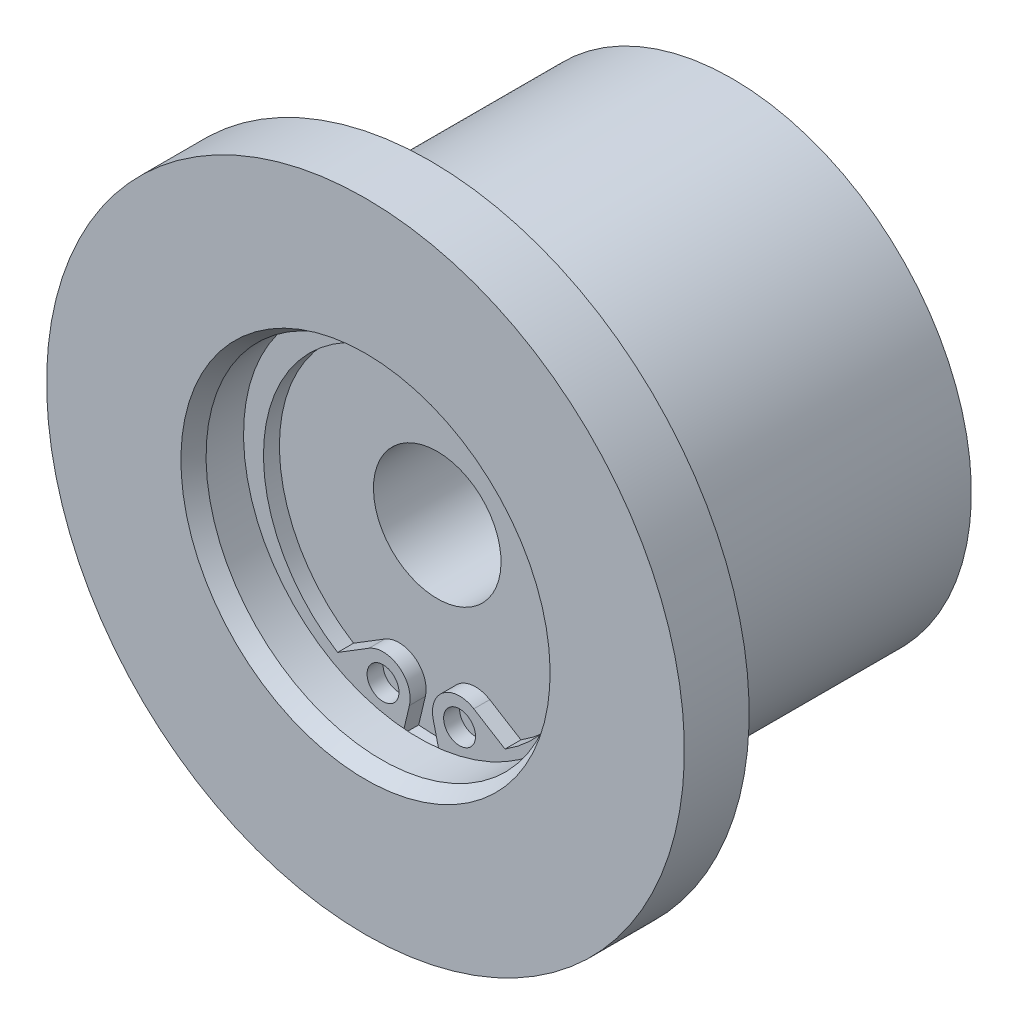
ISO-10303-21;
HEADER;
FILE_DESCRIPTION(('STEP AP214'),'2;1');
FILE_NAME('part.step','',(''),(''),'','','');
FILE_SCHEMA(('AUTOMOTIVE_DESIGN { 1 0 10303 214 1 1 1 1 }'));
ENDSEC;
DATA;
#1=APPLICATION_CONTEXT('core data for automotive mechanical design processes');
#2=APPLICATION_PROTOCOL_DEFINITION('international standard','automotive_design',2000,#1);
#3=PRODUCT_CONTEXT('',#1,'mechanical');
#4=PRODUCT('Part','Part','',(#3));
#5=PRODUCT_RELATED_PRODUCT_CATEGORY('part','',(#4));
#6=PRODUCT_DEFINITION_FORMATION('','',#4);
#7=PRODUCT_DEFINITION_CONTEXT('part definition',#1,'design');
#8=PRODUCT_DEFINITION('design','',#6,#7);
#9=PRODUCT_DEFINITION_SHAPE('','',#8);
#10=(LENGTH_UNIT() NAMED_UNIT(*) SI_UNIT(.MILLI.,.METRE.));
#11=(NAMED_UNIT(*) PLANE_ANGLE_UNIT() SI_UNIT($,.RADIAN.));
#12=(NAMED_UNIT(*) SI_UNIT($,.STERADIAN.) SOLID_ANGLE_UNIT());
#13=UNCERTAINTY_MEASURE_WITH_UNIT(LENGTH_MEASURE(1.E-05),#10,'distance_accuracy_value','');
#14=(GEOMETRIC_REPRESENTATION_CONTEXT(3) GLOBAL_UNCERTAINTY_ASSIGNED_CONTEXT((#13)) GLOBAL_UNIT_ASSIGNED_CONTEXT((#10,
#11,#12)) REPRESENTATION_CONTEXT('',''));
#15=CARTESIAN_POINT('',(0.,0.,0.));
#16=DIRECTION('',(0.,0.,1.));
#17=DIRECTION('',(1.,0.,0.));
#18=AXIS2_PLACEMENT_3D('',#15,#16,#17);
#19=CARTESIAN_POINT('',(0.,4.,7.));
#20=DIRECTION('',(0.,0.,1.));
#21=DIRECTION('',(0.,-1.,0.));
#22=AXIS2_PLACEMENT_3D('',#19,#20,#21);
#23=PLANE('',#22);
#24=CARTESIAN_POINT('',(2.4,-9.28614557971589,7.));
#25=DIRECTION('',(0.,0.,1.));
#26=DIRECTION('',(1.,0.,0.));
#27=AXIS2_PLACEMENT_3D('',#24,#25,#26);
#28=CIRCLE('',#27,1.);
#29=CARTESIAN_POINT('',(3.4,-9.28614557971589,7.));
#30=VERTEX_POINT('',#29);
#31=EDGE_CURVE('E551',#30,#30,#28,.T.);
#32=ORIENTED_EDGE('',*,*,#31,.T.);
#33=EDGE_LOOP('',(#32));
#34=FACE_BOUND('',#33,.T.);
#35=ADVANCED_FACE('F14',(#34),#23,.T.);
#36=CARTESIAN_POINT('',(-2.4,-9.28614557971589,7.));
#37=DIRECTION('',(0.,0.,-1.));
#38=DIRECTION('',(1.,0.,0.));
#39=AXIS2_PLACEMENT_3D('',#36,#37,#38);
#40=CIRCLE('',#39,1.);
#41=CARTESIAN_POINT('',(-1.4,-9.28614557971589,7.));
#42=VERTEX_POINT('',#41);
#43=EDGE_CURVE('E130',#42,#42,#40,.T.);
#44=ORIENTED_EDGE('',*,*,#43,.F.);
#45=EDGE_LOOP('',(#44));
#46=FACE_BOUND('',#45,.T.);
#47=ADVANCED_FACE('F184',(#46),#23,.T.);
#48=CARTESIAN_POINT('',(0.,0.,7.));
#49=DIRECTION('',(0.,0.,1.));
#50=DIRECTION('',(0.,-1.,0.));
#51=AXIS2_PLACEMENT_3D('',#48,#49,#50);
#52=CONICAL_SURFACE('',#51,15.,1.48352986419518);
#53=CARTESIAN_POINT('',(0.,0.,7.43744331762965));
#54=DIRECTION('',(0.,0.,-1.));
#55=DIRECTION('',(0.,1.,0.));
#56=AXIS2_PLACEMENT_3D('',#53,#54,#55);
#57=CIRCLE('',#56,20.);
#58=CARTESIAN_POINT('',(0.,20.,7.43744331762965));
#59=VERTEX_POINT('',#58);
#60=EDGE_CURVE('E173',#59,#59,#57,.T.);
#61=ORIENTED_EDGE('',*,*,#60,.T.);
#62=EDGE_LOOP('',(#61));
#63=FACE_BOUND('',#62,.T.);
#64=CARTESIAN_POINT('',(0.,0.,7.));
#65=DIRECTION('',(0.,0.,-1.));
#66=DIRECTION('',(0.,1.,0.));
#67=AXIS2_PLACEMENT_3D('',#64,#65,#66);
#68=CIRCLE('',#67,15.);
#69=CARTESIAN_POINT('',(0.,15.,7.));
#70=VERTEX_POINT('',#69);
#71=EDGE_CURVE('E131',#70,#70,#68,.T.);
#72=ORIENTED_EDGE('',*,*,#71,.F.);
#73=EDGE_LOOP('',(#72));
#74=FACE_BOUND('',#73,.T.);
#75=ADVANCED_FACE('F181',(#63,#74),#52,.T.);
#76=CARTESIAN_POINT('',(0.,0.,-20.3508614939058));
#77=DIRECTION('',(0.,0.,-1.));
#78=DIRECTION('',(0.,1.,0.));
#79=AXIS2_PLACEMENT_3D('',#76,#77,#78);
#80=CYLINDRICAL_SURFACE('',#79,20.);
#81=CARTESIAN_POINT('',(0.,0.,11.5));
#82=DIRECTION('',(0.,0.,-1.));
#83=DIRECTION('',(0.,1.,0.));
#84=AXIS2_PLACEMENT_3D('',#81,#82,#83);
#85=CIRCLE('',#84,20.);
#86=CARTESIAN_POINT('',(0.,20.,11.5));
#87=VERTEX_POINT('',#86);
#88=EDGE_CURVE('E170',#87,#87,#85,.T.);
#89=ORIENTED_EDGE('',*,*,#88,.T.);
#90=EDGE_LOOP('',(#89));
#91=FACE_BOUND('',#90,.T.);
#92=ORIENTED_EDGE('',*,*,#60,.F.);
#93=EDGE_LOOP('',(#92));
#94=FACE_BOUND('',#93,.T.);
#95=ADVANCED_FACE('F183',(#91,#94),#80,.T.);
#96=CARTESIAN_POINT('',(0.,0.,-20.3508614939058));
#97=DIRECTION('',(0.,0.,-1.));
#98=DIRECTION('',(0.,1.,0.));
#99=AXIS2_PLACEMENT_3D('',#96,#97,#98);
#100=CYLINDRICAL_SURFACE('',#99,15.);
#101=ORIENTED_EDGE('',*,*,#71,.T.);
#102=EDGE_LOOP('',(#101));
#103=FACE_BOUND('',#102,.T.);
#104=CARTESIAN_POINT('',(0.,0.,-11.5));
#105=DIRECTION('',(0.,0.,-1.));
#106=DIRECTION('',(0.,1.,0.));
#107=AXIS2_PLACEMENT_3D('',#104,#105,#106);
#108=CIRCLE('',#107,15.);
#109=CARTESIAN_POINT('',(0.,15.,-11.5));
#110=VERTEX_POINT('',#109);
#111=EDGE_CURVE('E142',#110,#110,#108,.T.);
#112=ORIENTED_EDGE('',*,*,#111,.F.);
#113=EDGE_LOOP('',(#112));
#114=FACE_BOUND('',#113,.T.);
#115=ADVANCED_FACE('F16',(#103,#114),#100,.T.);
#116=CARTESIAN_POINT('',(0.,20.,11.5));
#117=DIRECTION('',(0.,0.,1.));
#118=DIRECTION('',(0.,-1.,0.));
#119=AXIS2_PLACEMENT_3D('',#116,#117,#118);
#120=PLANE('',#119);
#121=CARTESIAN_POINT('',(0.,0.,11.5));
#122=DIRECTION('',(0.,0.,-1.));
#123=DIRECTION('',(0.,1.,0.));
#124=AXIS2_PLACEMENT_3D('',#121,#122,#123);
#125=CIRCLE('',#124,11.5773502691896);
#126=CARTESIAN_POINT('',(0.,11.5773502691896,11.5));
#127=VERTEX_POINT('',#126);
#128=EDGE_CURVE('E167',#127,#127,#125,.T.);
#129=ORIENTED_EDGE('',*,*,#128,.T.);
#130=EDGE_LOOP('',(#129));
#131=FACE_BOUND('',#130,.T.);
#132=ORIENTED_EDGE('',*,*,#88,.F.);
#133=EDGE_LOOP('',(#132));
#134=FACE_BOUND('',#133,.T.);
#135=ADVANCED_FACE('F248',(#131,#134),#120,.T.);
#136=CARTESIAN_POINT('',(0.,9.,-11.5));
#137=DIRECTION('',(0.,0.,-1.));
#138=DIRECTION('',(0.,1.,0.));
#139=AXIS2_PLACEMENT_3D('',#136,#137,#138);
#140=PLANE('',#139);
#141=ORIENTED_EDGE('',*,*,#111,.T.);
#142=EDGE_LOOP('',(#141));
#143=FACE_BOUND('',#142,.T.);
#144=CARTESIAN_POINT('',(0.,0.,-11.5));
#145=DIRECTION('',(0.,0.,-1.));
#146=DIRECTION('',(0.,1.,0.));
#147=AXIS2_PLACEMENT_3D('',#144,#145,#146);
#148=CIRCLE('',#147,9.);
#149=CARTESIAN_POINT('',(0.,9.,-11.5));
#150=VERTEX_POINT('',#149);
#151=EDGE_CURVE('E145',#150,#150,#148,.T.);
#152=ORIENTED_EDGE('',*,*,#151,.F.);
#153=EDGE_LOOP('',(#152));
#154=FACE_BOUND('',#153,.T.);
#155=ADVANCED_FACE('F244',(#143,#154),#140,.T.);
#156=CARTESIAN_POINT('',(0.,0.,11.5));
#157=DIRECTION('',(0.,0.,1.));
#158=DIRECTION('',(0.,-1.,0.));
#159=AXIS2_PLACEMENT_3D('',#156,#157,#158);
#160=CONICAL_SURFACE('',#159,11.5773502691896,0.5235987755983);
#161=CARTESIAN_POINT('',(0.,0.,10.5));
#162=DIRECTION('',(0.,0.,-1.));
#163=DIRECTION('',(0.,1.,0.));
#164=AXIS2_PLACEMENT_3D('',#161,#162,#163);
#165=CIRCLE('',#164,11.);
#166=CARTESIAN_POINT('',(0.,11.,10.5));
#167=VERTEX_POINT('',#166);
#168=EDGE_CURVE('E164',#167,#167,#165,.T.);
#169=ORIENTED_EDGE('',*,*,#168,.T.);
#170=EDGE_LOOP('',(#169));
#171=FACE_BOUND('',#170,.T.);
#172=ORIENTED_EDGE('',*,*,#128,.F.);
#173=EDGE_LOOP('',(#172));
#174=FACE_BOUND('',#173,.T.);
#175=ADVANCED_FACE('F247',(#171,#174),#160,.F.);
#176=CARTESIAN_POINT('',(0.,0.,-20.3508614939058));
#177=DIRECTION('',(0.,0.,-1.));
#178=DIRECTION('',(0.,1.,0.));
#179=AXIS2_PLACEMENT_3D('',#176,#177,#178);
#180=CYLINDRICAL_SURFACE('',#179,9.);
#181=ORIENTED_EDGE('',*,*,#151,.T.);
#182=EDGE_LOOP('',(#181));
#183=FACE_BOUND('',#182,.T.);
#184=CARTESIAN_POINT('',(0.,0.,-7.));
#185=DIRECTION('',(0.,0.,-1.));
#186=DIRECTION('',(0.,1.,0.));
#187=AXIS2_PLACEMENT_3D('',#184,#185,#186);
#188=CIRCLE('',#187,9.);
#189=CARTESIAN_POINT('',(0.,9.,-7.));
#190=VERTEX_POINT('',#189);
#191=EDGE_CURVE('E148',#190,#190,#188,.T.);
#192=ORIENTED_EDGE('',*,*,#191,.F.);
#193=EDGE_LOOP('',(#192));
#194=FACE_BOUND('',#193,.T.);
#195=ADVANCED_FACE('F250',(#183,#194),#180,.F.);
#196=CARTESIAN_POINT('',(0.,0.,-20.3508614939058));
#197=DIRECTION('',(0.,0.,-1.));
#198=DIRECTION('',(0.,1.,0.));
#199=AXIS2_PLACEMENT_3D('',#196,#197,#198);
#200=CYLINDRICAL_SURFACE('',#199,11.);
#201=CARTESIAN_POINT('',(0.,0.,8.15));
#202=DIRECTION('',(0.,0.,-1.));
#203=DIRECTION('',(0.,1.,0.));
#204=AXIS2_PLACEMENT_3D('',#201,#202,#203);
#205=CIRCLE('',#204,11.);
#206=CARTESIAN_POINT('',(0.,11.,8.15));
#207=VERTEX_POINT('',#206);
#208=EDGE_CURVE('E161',#207,#207,#205,.T.);
#209=ORIENTED_EDGE('',*,*,#208,.T.);
#210=EDGE_LOOP('',(#209));
#211=FACE_BOUND('',#210,.T.);
#212=ORIENTED_EDGE('',*,*,#168,.F.);
#213=EDGE_LOOP('',(#212));
#214=FACE_BOUND('',#213,.T.);
#215=ADVANCED_FACE('F253',(#211,#214),#200,.F.);
#216=CARTESIAN_POINT('',(0.,9.,-7.));
#217=DIRECTION('',(0.,0.,-1.));
#218=DIRECTION('',(0.,1.,0.));
#219=AXIS2_PLACEMENT_3D('',#216,#217,#218);
#220=PLANE('',#219);
#221=ORIENTED_EDGE('',*,*,#191,.T.);
#222=EDGE_LOOP('',(#221));
#223=FACE_BOUND('',#222,.T.);
#224=CARTESIAN_POINT('',(0.,0.,-7.));
#225=DIRECTION('',(0.,0.,-1.));
#226=DIRECTION('',(0.,1.,0.));
#227=AXIS2_PLACEMENT_3D('',#224,#225,#226);
#228=CIRCLE('',#227,4.);
#229=CARTESIAN_POINT('',(0.,4.,-7.));
#230=VERTEX_POINT('',#229);
#231=EDGE_CURVE('E151',#230,#230,#228,.T.);
#232=ORIENTED_EDGE('',*,*,#231,.F.);
#233=EDGE_LOOP('',(#232));
#234=FACE_BOUND('',#233,.T.);
#235=ADVANCED_FACE('F255',(#223,#234),#220,.T.);
#236=CARTESIAN_POINT('',(0.,11.5,8.15));
#237=DIRECTION('',(0.,0.,-1.));
#238=DIRECTION('',(0.,1.,0.));
#239=AXIS2_PLACEMENT_3D('',#236,#237,#238);
#240=PLANE('',#239);
#241=CARTESIAN_POINT('',(0.,0.,8.15));
#242=DIRECTION('',(0.,0.,-1.));
#243=DIRECTION('',(0.,1.,0.));
#244=AXIS2_PLACEMENT_3D('',#241,#242,#243);
#245=CIRCLE('',#244,11.5);
#246=CARTESIAN_POINT('',(0.,11.5,8.15));
#247=VERTEX_POINT('',#246);
#248=EDGE_CURVE('E158',#247,#247,#245,.T.);
#249=ORIENTED_EDGE('',*,*,#248,.T.);
#250=EDGE_LOOP('',(#249));
#251=FACE_BOUND('',#250,.T.);
#252=ORIENTED_EDGE('',*,*,#208,.F.);
#253=EDGE_LOOP('',(#252));
#254=FACE_BOUND('',#253,.T.);
#255=ADVANCED_FACE('F257',(#251,#254),#240,.T.);
#256=CARTESIAN_POINT('',(0.,0.,-20.3508614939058));
#257=DIRECTION('',(0.,0.,-1.));
#258=DIRECTION('',(0.,1.,0.));
#259=AXIS2_PLACEMENT_3D('',#256,#257,#258);
#260=CYLINDRICAL_SURFACE('',#259,11.5);
#261=ORIENTED_EDGE('',*,*,#248,.F.);
#262=EDGE_LOOP('',(#261));
#263=FACE_BOUND('',#262,.T.);
#264=DIRECTION('',(0.,0.,-1.));
#265=VECTOR('',#264,1.);
#266=CARTESIAN_POINT('',(1.16498191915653,-11.440839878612,-20.3508614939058));
#267=LINE('',#266,#265);
#268=CARTESIAN_POINT('',(1.16498191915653,-11.440839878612,7.));
#269=VERTEX_POINT('',#268);
#270=CARTESIAN_POINT('',(1.16498191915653,-11.440839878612,8.));
#271=VERTEX_POINT('',#270);
#272=EDGE_CURVE('E18',#269,#271,#267,.F.);
#273=ORIENTED_EDGE('',*,*,#272,.F.);
#274=CARTESIAN_POINT('',(0.,0.,7.));
#275=DIRECTION('',(0.,0.,-1.));
#276=DIRECTION('',(0.,1.,0.));
#277=AXIS2_PLACEMENT_3D('',#274,#275,#276);
#278=CIRCLE('',#277,11.5);
#279=CARTESIAN_POINT('',(-1.16498191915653,-11.440839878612,7.));
#280=VERTEX_POINT('',#279);
#281=EDGE_CURVE('E107',#269,#280,#278,.T.);
#282=ORIENTED_EDGE('',*,*,#281,.T.);
#283=DIRECTION('',(0.,0.,-1.));
#284=VECTOR('',#283,1.);
#285=CARTESIAN_POINT('',(-1.16498191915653,-11.440839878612,-20.3508614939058));
#286=LINE('',#285,#284);
#287=CARTESIAN_POINT('',(-1.16498191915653,-11.440839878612,8.));
#288=VERTEX_POINT('',#287);
#289=EDGE_CURVE('E138',#288,#280,#286,.T.);
#290=ORIENTED_EDGE('',*,*,#289,.F.);
#291=CARTESIAN_POINT('',(0.,0.,8.));
#292=DIRECTION('',(0.,0.,-1.));
#293=DIRECTION('',(-1.,0.,0.));
#294=AXIS2_PLACEMENT_3D('',#291,#292,#293);
#295=CIRCLE('',#294,11.5);
#296=EDGE_CURVE('E9',#271,#288,#295,.F.);
#297=ORIENTED_EDGE('',*,*,#296,.F.);
#298=EDGE_LOOP('',(#273,#282,#290,#297));
#299=FACE_BOUND('',#298,.T.);
#300=ADVANCED_FACE('F260',(#263,#299),#260,.F.);
#301=CARTESIAN_POINT('',(0.,0.,-20.3508614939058));
#302=DIRECTION('',(0.,0.,-1.));
#303=DIRECTION('',(0.,1.,0.));
#304=AXIS2_PLACEMENT_3D('',#301,#302,#303);
#305=CYLINDRICAL_SURFACE('',#304,4.);
#306=ORIENTED_EDGE('',*,*,#231,.T.);
#307=EDGE_LOOP('',(#306));
#308=FACE_BOUND('',#307,.T.);
#309=CARTESIAN_POINT('',(0.,0.,7.));
#310=DIRECTION('',(0.,0.,-1.));
#311=DIRECTION('',(0.,1.,0.));
#312=AXIS2_PLACEMENT_3D('',#309,#310,#311);
#313=CIRCLE('',#312,4.);
#314=CARTESIAN_POINT('',(0.,4.,7.));
#315=VERTEX_POINT('',#314);
#316=EDGE_CURVE('E154',#315,#315,#313,.T.);
#317=ORIENTED_EDGE('',*,*,#316,.F.);
#318=EDGE_LOOP('',(#317));
#319=FACE_BOUND('',#318,.T.);
#320=ADVANCED_FACE('F204',(#308,#319),#305,.F.);
#321=ORIENTED_EDGE('',*,*,#316,.T.);
#322=EDGE_LOOP('',(#321));
#323=FACE_BOUND('',#322,.T.);
#324=DIRECTION('',(0.231349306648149,-0.972870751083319,0.));
#325=VECTOR('',#324,1.);
#326=CARTESIAN_POINT('',(0.746119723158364,-9.67943940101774,7.));
#327=LINE('',#326,#325);
#328=CARTESIAN_POINT('',(0.746119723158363,-9.67943940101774,7.));
#329=VERTEX_POINT('',#328);
#330=EDGE_CURVE('E34',#329,#269,#327,.T.);
#331=ORIENTED_EDGE('',*,*,#330,.F.);
#332=CARTESIAN_POINT('',(2.4,-9.28614557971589,7.));
#333=DIRECTION('',(0.,0.,1.));
#334=DIRECTION('',(1.,0.,0.));
#335=AXIS2_PLACEMENT_3D('',#332,#333,#334);
#336=CIRCLE('',#335,1.7);
#337=CARTESIAN_POINT('',(3.29136923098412,-7.83857489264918,7.));
#338=VERTEX_POINT('',#337);
#339=EDGE_CURVE('E94',#338,#329,#336,.T.);
#340=ORIENTED_EDGE('',*,*,#339,.F.);
#341=DIRECTION('',(-0.851512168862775,0.524334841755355,0.));
#342=VECTOR('',#341,1.);
#343=CARTESIAN_POINT('',(3.29136923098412,-7.83857489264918,7.));
#344=LINE('',#343,#342);
#345=CARTESIAN_POINT('',(5.2489218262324,-9.04397520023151,7.));
#346=VERTEX_POINT('',#345);
#347=EDGE_CURVE('E136',#346,#338,#344,.T.);
#348=ORIENTED_EDGE('',*,*,#347,.F.);
#349=CARTESIAN_POINT('',(0.,-0.65,7.));
#350=DIRECTION('',(0.,0.,-1.));
#351=DIRECTION('',(0.,-1.,0.));
#352=AXIS2_PLACEMENT_3D('',#349,#350,#351);
#353=CIRCLE('',#352,9.9);
#354=CARTESIAN_POINT('',(-5.24892182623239,-9.04397520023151,7.));
#355=VERTEX_POINT('',#354);
#356=EDGE_CURVE('E555',#355,#346,#353,.T.);
#357=ORIENTED_EDGE('',*,*,#356,.F.);
#358=DIRECTION('',(-0.851512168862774,-0.524334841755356,0.));
#359=VECTOR('',#358,1.);
#360=CARTESIAN_POINT('',(-3.29136923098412,-7.83857489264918,7.));
#361=LINE('',#360,#359);
#362=CARTESIAN_POINT('',(-3.29136923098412,-7.83857489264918,7.));
#363=VERTEX_POINT('',#362);
#364=EDGE_CURVE('E141',#363,#355,#361,.T.);
#365=ORIENTED_EDGE('',*,*,#364,.F.);
#366=CARTESIAN_POINT('',(-2.4,-9.28614557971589,7.));
#367=DIRECTION('',(0.,0.,1.));
#368=DIRECTION('',(-1.,0.,0.));
#369=AXIS2_PLACEMENT_3D('',#366,#367,#368);
#370=CIRCLE('',#369,1.7);
#371=CARTESIAN_POINT('',(-0.746119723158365,-9.67943940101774,7.));
#372=VERTEX_POINT('',#371);
#373=EDGE_CURVE('E121',#372,#363,#370,.T.);
#374=ORIENTED_EDGE('',*,*,#373,.F.);
#375=DIRECTION('',(0.231349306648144,0.97287075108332,0.));
#376=VECTOR('',#375,1.);
#377=CARTESIAN_POINT('',(-0.746119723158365,-9.67943940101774,7.));
#378=LINE('',#377,#376);
#379=EDGE_CURVE('E115',#280,#372,#378,.T.);
#380=ORIENTED_EDGE('',*,*,#379,.F.);
#381=ORIENTED_EDGE('',*,*,#281,.F.);
#382=EDGE_LOOP('',(#331,#340,#348,#357,#365,#374,#380,#381));
#383=FACE_BOUND('',#382,.T.);
#384=ADVANCED_FACE('F105',(#323,#383),#23,.T.);
#385=CARTESIAN_POINT('',(0.,-0.65,8.));
#386=DIRECTION('',(0.,0.,1.));
#387=DIRECTION('',(-1.,0.,0.));
#388=AXIS2_PLACEMENT_3D('',#385,#386,#387);
#389=CYLINDRICAL_SURFACE('',#388,9.9);
#390=ORIENTED_EDGE('',*,*,#356,.T.);
#391=DIRECTION('',(0.,0.,-1.));
#392=VECTOR('',#391,1.);
#393=CARTESIAN_POINT('',(5.2489218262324,-9.04397520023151,8.));
#394=LINE('',#393,#392);
#395=CARTESIAN_POINT('',(5.2489218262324,-9.04397520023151,8.));
#396=VERTEX_POINT('',#395);
#397=EDGE_CURVE('E132',#396,#346,#394,.T.);
#398=ORIENTED_EDGE('',*,*,#397,.F.);
#399=CARTESIAN_POINT('',(0.,-0.65,8.));
#400=DIRECTION('',(0.,0.,-1.));
#401=DIRECTION('',(0.,-1.,0.));
#402=AXIS2_PLACEMENT_3D('',#399,#400,#401);
#403=CIRCLE('',#402,9.9);
#404=CARTESIAN_POINT('',(-5.24892182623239,-9.04397520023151,8.));
#405=VERTEX_POINT('',#404);
#406=EDGE_CURVE('E529',#405,#396,#403,.T.);
#407=ORIENTED_EDGE('',*,*,#406,.F.);
#408=DIRECTION('',(0.,0.,-1.));
#409=VECTOR('',#408,1.);
#410=CARTESIAN_POINT('',(-5.24892182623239,-9.04397520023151,8.));
#411=LINE('',#410,#409);
#412=EDGE_CURVE('E125',#405,#355,#411,.T.);
#413=ORIENTED_EDGE('',*,*,#412,.T.);
#414=EDGE_LOOP('',(#390,#398,#407,#413));
#415=FACE_BOUND('',#414,.T.);
#416=ADVANCED_FACE('F197',(#415),#389,.F.);
#417=CARTESIAN_POINT('',(3.29136923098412,-7.83857489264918,8.));
#418=DIRECTION('',(-0.524334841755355,-0.851512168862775,0.));
#419=DIRECTION('',(-0.851512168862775,0.524334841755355,0.));
#420=AXIS2_PLACEMENT_3D('',#417,#418,#419);
#421=PLANE('',#420);
#422=ORIENTED_EDGE('',*,*,#347,.T.);
#423=DIRECTION('',(0.,0.,-1.));
#424=VECTOR('',#423,1.);
#425=CARTESIAN_POINT('',(3.29136923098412,-7.83857489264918,8.));
#426=LINE('',#425,#424);
#427=CARTESIAN_POINT('',(3.29136923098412,-7.83857489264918,8.));
#428=VERTEX_POINT('',#427);
#429=EDGE_CURVE('E98',#428,#338,#426,.T.);
#430=ORIENTED_EDGE('',*,*,#429,.F.);
#431=DIRECTION('',(-0.851512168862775,0.524334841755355,0.));
#432=VECTOR('',#431,1.);
#433=CARTESIAN_POINT('',(3.29136923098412,-7.83857489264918,8.));
#434=LINE('',#433,#432);
#435=EDGE_CURVE('E532',#396,#428,#434,.T.);
#436=ORIENTED_EDGE('',*,*,#435,.F.);
#437=ORIENTED_EDGE('',*,*,#397,.T.);
#438=EDGE_LOOP('',(#422,#430,#436,#437));
#439=FACE_BOUND('',#438,.T.);
#440=ADVANCED_FACE('F207',(#439),#421,.F.);
#441=CARTESIAN_POINT('',(2.4,-9.28614557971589,8.));
#442=DIRECTION('',(0.,0.,1.));
#443=DIRECTION('',(-1.,0.,0.));
#444=AXIS2_PLACEMENT_3D('',#441,#442,#443);
#445=CYLINDRICAL_SURFACE('',#444,1.7);
#446=ORIENTED_EDGE('',*,*,#339,.T.);
#447=DIRECTION('',(0.,0.,-1.));
#448=VECTOR('',#447,1.);
#449=CARTESIAN_POINT('',(0.746119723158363,-9.67943940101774,8.));
#450=LINE('',#449,#448);
#451=CARTESIAN_POINT('',(0.746119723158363,-9.67943940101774,8.));
#452=VERTEX_POINT('',#451);
#453=EDGE_CURVE('E97',#452,#329,#450,.T.);
#454=ORIENTED_EDGE('',*,*,#453,.F.);
#455=CARTESIAN_POINT('',(2.4,-9.28614557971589,8.));
#456=DIRECTION('',(0.,0.,1.));
#457=DIRECTION('',(1.,0.,0.));
#458=AXIS2_PLACEMENT_3D('',#455,#456,#457);
#459=CIRCLE('',#458,1.7);
#460=EDGE_CURVE('E517',#428,#452,#459,.T.);
#461=ORIENTED_EDGE('',*,*,#460,.F.);
#462=ORIENTED_EDGE('',*,*,#429,.T.);
#463=EDGE_LOOP('',(#446,#454,#461,#462));
#464=FACE_BOUND('',#463,.T.);
#465=ADVANCED_FACE('F95',(#464),#445,.T.);
#466=CARTESIAN_POINT('',(-0.746119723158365,-9.67943940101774,8.));
#467=DIRECTION('',(-0.97287075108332,0.231349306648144,0.));
#468=DIRECTION('',(0.,0.,1.));
#469=AXIS2_PLACEMENT_3D('',#466,#467,#468);
#470=PLANE('',#469);
#471=DIRECTION('',(0.231349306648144,0.97287075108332,0.));
#472=VECTOR('',#471,1.);
#473=CARTESIAN_POINT('',(-0.746119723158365,-9.67943940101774,8.));
#474=LINE('',#473,#472);
#475=CARTESIAN_POINT('',(-0.746119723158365,-9.67943940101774,8.));
#476=VERTEX_POINT('',#475);
#477=EDGE_CURVE('E460',#288,#476,#474,.T.);
#478=ORIENTED_EDGE('',*,*,#477,.F.);
#479=ORIENTED_EDGE('',*,*,#289,.T.);
#480=ORIENTED_EDGE('',*,*,#379,.T.);
#481=DIRECTION('',(0.,0.,-1.));
#482=VECTOR('',#481,1.);
#483=CARTESIAN_POINT('',(-0.746119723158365,-9.67943940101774,8.));
#484=LINE('',#483,#482);
#485=EDGE_CURVE('E536',#476,#372,#484,.T.);
#486=ORIENTED_EDGE('',*,*,#485,.F.);
#487=EDGE_LOOP('',(#478,#479,#480,#486));
#488=FACE_BOUND('',#487,.T.);
#489=ADVANCED_FACE('F232',(#488),#470,.F.);
#490=CARTESIAN_POINT('',(0.,-0.65,8.));
#491=DIRECTION('',(0.,0.,-1.));
#492=DIRECTION('',(0.,-1.,0.));
#493=AXIS2_PLACEMENT_3D('',#490,#491,#492);
#494=PLANE('',#493);
#495=CARTESIAN_POINT('',(-2.4,-9.28614557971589,8.));
#496=DIRECTION('',(0.,0.,-1.));
#497=DIRECTION('',(1.,0.,0.));
#498=AXIS2_PLACEMENT_3D('',#495,#496,#497);
#499=CIRCLE('',#498,1.);
#500=CARTESIAN_POINT('',(-1.4,-9.28614557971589,8.));
#501=VERTEX_POINT('',#500);
#502=EDGE_CURVE('E102',#501,#501,#499,.T.);
#503=ORIENTED_EDGE('',*,*,#502,.T.);
#504=EDGE_LOOP('',(#503));
#505=FACE_BOUND('',#504,.T.);
#506=CARTESIAN_POINT('',(2.4,-9.28614557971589,8.));
#507=DIRECTION('',(0.,0.,1.));
#508=DIRECTION('',(1.,0.,0.));
#509=AXIS2_PLACEMENT_3D('',#506,#507,#508);
#510=CIRCLE('',#509,1.);
#511=CARTESIAN_POINT('',(3.4,-9.28614557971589,8.));
#512=VERTEX_POINT('',#511);
#513=EDGE_CURVE('E127',#512,#512,#510,.T.);
#514=ORIENTED_EDGE('',*,*,#513,.F.);
#515=EDGE_LOOP('',(#514));
#516=FACE_BOUND('',#515,.T.);
#517=DIRECTION('',(0.231349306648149,-0.972870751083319,0.));
#518=VECTOR('',#517,1.);
#519=CARTESIAN_POINT('',(0.746119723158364,-9.67943940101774,8.));
#520=LINE('',#519,#518);
#521=EDGE_CURVE('E112',#452,#271,#520,.T.);
#522=ORIENTED_EDGE('',*,*,#521,.T.);
#523=ORIENTED_EDGE('',*,*,#296,.T.);
#524=ORIENTED_EDGE('',*,*,#477,.T.);
#525=CARTESIAN_POINT('',(-2.4,-9.28614557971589,8.));
#526=DIRECTION('',(0.,0.,1.));
#527=DIRECTION('',(-1.,0.,0.));
#528=AXIS2_PLACEMENT_3D('',#525,#526,#527);
#529=CIRCLE('',#528,1.7);
#530=CARTESIAN_POINT('',(-3.29136923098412,-7.83857489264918,8.));
#531=VERTEX_POINT('',#530);
#532=EDGE_CURVE('E462',#476,#531,#529,.T.);
#533=ORIENTED_EDGE('',*,*,#532,.T.);
#534=DIRECTION('',(-0.851512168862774,-0.524334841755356,0.));
#535=VECTOR('',#534,1.);
#536=CARTESIAN_POINT('',(-3.29136923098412,-7.83857489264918,8.));
#537=LINE('',#536,#535);
#538=EDGE_CURVE('E137',#531,#405,#537,.T.);
#539=ORIENTED_EDGE('',*,*,#538,.T.);
#540=ORIENTED_EDGE('',*,*,#406,.T.);
#541=ORIENTED_EDGE('',*,*,#435,.T.);
#542=ORIENTED_EDGE('',*,*,#460,.T.);
#543=EDGE_LOOP('',(#522,#523,#524,#533,#539,#540,#541,#542));
#544=FACE_BOUND('',#543,.T.);
#545=ADVANCED_FACE('F224',(#505,#516,#544),#494,.F.);
#546=CARTESIAN_POINT('',(2.4,-9.28614557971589,8.));
#547=DIRECTION('',(0.,0.,1.));
#548=DIRECTION('',(-1.,0.,0.));
#549=AXIS2_PLACEMENT_3D('',#546,#547,#548);
#550=CYLINDRICAL_SURFACE('',#549,1.);
#551=ORIENTED_EDGE('',*,*,#31,.F.);
#552=EDGE_LOOP('',(#551));
#553=FACE_BOUND('',#552,.T.);
#554=ORIENTED_EDGE('',*,*,#513,.T.);
#555=EDGE_LOOP('',(#554));
#556=FACE_BOUND('',#555,.T.);
#557=ADVANCED_FACE('F220',(#553,#556),#550,.F.);
#558=CARTESIAN_POINT('',(-2.4,-9.28614557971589,8.));
#559=DIRECTION('',(0.,0.,1.));
#560=DIRECTION('',(-1.,0.,0.));
#561=AXIS2_PLACEMENT_3D('',#558,#559,#560);
#562=CYLINDRICAL_SURFACE('',#561,1.);
#563=ORIENTED_EDGE('',*,*,#43,.T.);
#564=EDGE_LOOP('',(#563));
#565=FACE_BOUND('',#564,.T.);
#566=ORIENTED_EDGE('',*,*,#502,.F.);
#567=EDGE_LOOP('',(#566));
#568=FACE_BOUND('',#567,.T.);
#569=ADVANCED_FACE('F216',(#565,#568),#562,.F.);
#570=CARTESIAN_POINT('',(-3.29136923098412,-7.83857489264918,8.));
#571=DIRECTION('',(0.524334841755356,-0.851512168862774,0.));
#572=DIRECTION('',(0.,0.,-1.));
#573=AXIS2_PLACEMENT_3D('',#570,#571,#572);
#574=PLANE('',#573);
#575=ORIENTED_EDGE('',*,*,#364,.T.);
#576=ORIENTED_EDGE('',*,*,#412,.F.);
#577=ORIENTED_EDGE('',*,*,#538,.F.);
#578=DIRECTION('',(0.,0.,-1.));
#579=VECTOR('',#578,1.);
#580=CARTESIAN_POINT('',(-3.29136923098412,-7.83857489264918,8.));
#581=LINE('',#580,#579);
#582=EDGE_CURVE('E544',#531,#363,#581,.T.);
#583=ORIENTED_EDGE('',*,*,#582,.T.);
#584=EDGE_LOOP('',(#575,#576,#577,#583));
#585=FACE_BOUND('',#584,.T.);
#586=ADVANCED_FACE('F219',(#585),#574,.F.);
#587=CARTESIAN_POINT('',(-2.4,-9.28614557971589,8.));
#588=DIRECTION('',(0.,0.,1.));
#589=DIRECTION('',(-1.,0.,0.));
#590=AXIS2_PLACEMENT_3D('',#587,#588,#589);
#591=CYLINDRICAL_SURFACE('',#590,1.7);
#592=ORIENTED_EDGE('',*,*,#373,.T.);
#593=ORIENTED_EDGE('',*,*,#582,.F.);
#594=ORIENTED_EDGE('',*,*,#532,.F.);
#595=ORIENTED_EDGE('',*,*,#485,.T.);
#596=EDGE_LOOP('',(#592,#593,#594,#595));
#597=FACE_BOUND('',#596,.T.);
#598=ADVANCED_FACE('F226',(#597),#591,.T.);
#599=CARTESIAN_POINT('',(0.746119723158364,-9.67943940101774,8.));
#600=DIRECTION('',(0.972870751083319,0.231349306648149,0.));
#601=DIRECTION('',(0.,0.,-1.));
#602=AXIS2_PLACEMENT_3D('',#599,#600,#601);
#603=PLANE('',#602);
#604=ORIENTED_EDGE('',*,*,#330,.T.);
#605=ORIENTED_EDGE('',*,*,#272,.T.);
#606=ORIENTED_EDGE('',*,*,#521,.F.);
#607=ORIENTED_EDGE('',*,*,#453,.T.);
#608=EDGE_LOOP('',(#604,#605,#606,#607));
#609=FACE_BOUND('',#608,.T.);
#610=ADVANCED_FACE('F110',(#609),#603,.F.);
#611=CLOSED_SHELL('',(#35,#47,#75,#95,#115,#135,#155,#175,#195,#215,#235,#255,#300,#320,#384,
#416,#440,#465,#489,#545,#557,#569,#586,#598,#610));
#612=MANIFOLD_SOLID_BREP('B1',#611);
#613=ADVANCED_BREP_SHAPE_REPRESENTATION('',(#18,#612),#14);
#614=SHAPE_DEFINITION_REPRESENTATION(#9,#613);
ENDSEC;
END-ISO-10303-21;
